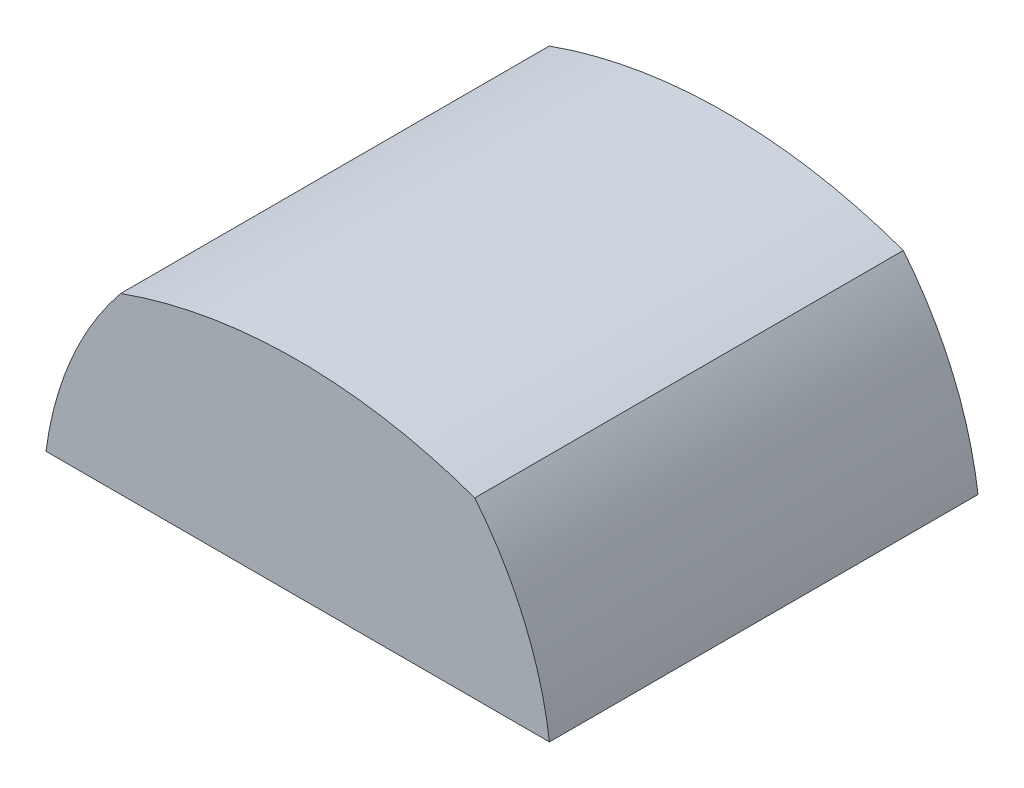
from build123d import *

# Parameters (mm, degrees)
EXTRUDE1_DEPTH = 91.694


with BuildPart() as part:
    # Sketch1 → Extrude1 (new body)
    with BuildSketch(Plane.XY):
        with BuildLine():
            Line((-53.85754169, 0), (53.85754169, 0))
            ThreePointArc((53.85754169, 0), (48.466653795, 19.732737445), (37.880663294, 37.236434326))
            ThreePointArc((37.880663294, 37.236434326), (0, 43.821991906), (-37.880663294, 37.236434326))
            ThreePointArc((-37.880663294, 37.236434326), (-48.466653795, 19.732737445), (-53.85754169, 0))
        make_face()
    extrude(amount=EXTRUDE1_DEPTH)


solid = part.part
